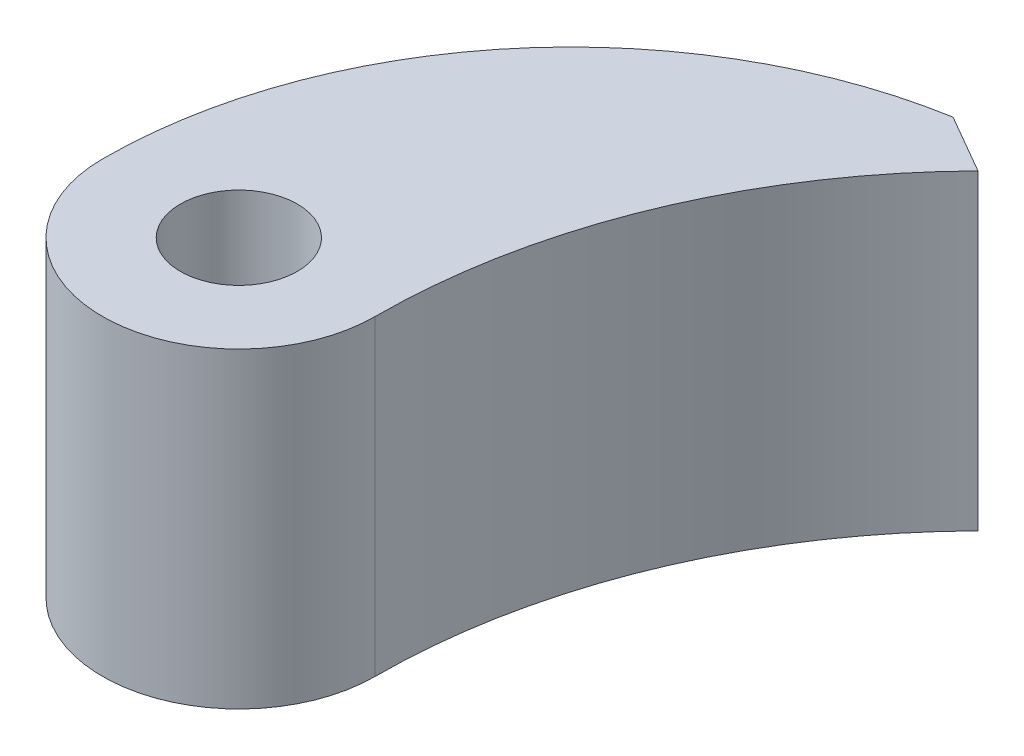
ISO-10303-21;
HEADER;
FILE_DESCRIPTION(('STEP AP214'),'2;1');
FILE_NAME('part.step','',(''),(''),'','','');
FILE_SCHEMA(('AUTOMOTIVE_DESIGN { 1 0 10303 214 1 1 1 1 }'));
ENDSEC;
DATA;
#1=APPLICATION_CONTEXT('core data for automotive mechanical design processes');
#2=APPLICATION_PROTOCOL_DEFINITION('international standard','automotive_design',2000,#1);
#3=PRODUCT_CONTEXT('',#1,'mechanical');
#4=PRODUCT('Part','Part','',(#3));
#5=PRODUCT_RELATED_PRODUCT_CATEGORY('part','',(#4));
#6=PRODUCT_DEFINITION_FORMATION('','',#4);
#7=PRODUCT_DEFINITION_CONTEXT('part definition',#1,'design');
#8=PRODUCT_DEFINITION('design','',#6,#7);
#9=PRODUCT_DEFINITION_SHAPE('','',#8);
#10=(LENGTH_UNIT() NAMED_UNIT(*) SI_UNIT(.MILLI.,.METRE.));
#11=(NAMED_UNIT(*) PLANE_ANGLE_UNIT() SI_UNIT($,.RADIAN.));
#12=(NAMED_UNIT(*) SI_UNIT($,.STERADIAN.) SOLID_ANGLE_UNIT());
#13=UNCERTAINTY_MEASURE_WITH_UNIT(LENGTH_MEASURE(1.E-05),#10,'distance_accuracy_value','');
#14=(GEOMETRIC_REPRESENTATION_CONTEXT(3) GLOBAL_UNCERTAINTY_ASSIGNED_CONTEXT((#13)) GLOBAL_UNIT_ASSIGNED_CONTEXT((#10,
#11,#12)) REPRESENTATION_CONTEXT('',''));
#15=CARTESIAN_POINT('',(0.,0.,0.));
#16=DIRECTION('',(0.,0.,1.));
#17=DIRECTION('',(1.,0.,0.));
#18=AXIS2_PLACEMENT_3D('',#15,#16,#17);
#19=CARTESIAN_POINT('',(-31.2165063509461,-26.5,7.18182368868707));
#20=DIRECTION('',(0.,-1.,0.));
#21=DIRECTION('',(0.,0.,-1.));
#22=AXIS2_PLACEMENT_3D('',#19,#20,#21);
#23=PLANE('',#22);
#24=CARTESIAN_POINT('',(-31.2165063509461,-26.5,7.18182368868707));
#25=DIRECTION('',(0.,1.,0.));
#26=DIRECTION('',(0.,0.,-1.));
#27=AXIS2_PLACEMENT_3D('',#24,#25,#26);
#28=CIRCLE('',#27,3.5);
#29=CARTESIAN_POINT('',(-34.7165063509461,-26.5,7.18182368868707));
#30=VERTEX_POINT('',#29);
#31=CARTESIAN_POINT('',(-27.7165063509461,-26.5,7.18182368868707));
#32=VERTEX_POINT('',#31);
#33=EDGE_CURVE('E84',#30,#32,#28,.T.);
#34=ORIENTED_EDGE('',*,*,#33,.T.);
#35=CARTESIAN_POINT('',(-12.0961359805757,-26.5,7.18182368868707));
#36=DIRECTION('',(0.,-1.,0.));
#37=DIRECTION('',(0.,0.,1.));
#38=AXIS2_PLACEMENT_3D('',#35,#36,#37);
#39=CIRCLE('',#38,15.6203703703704);
#40=CARTESIAN_POINT('',(-23.2165063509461,-26.5,-3.78783142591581));
#41=VERTEX_POINT('',#40);
#42=EDGE_CURVE('E79',#32,#41,#39,.T.);
#43=ORIENTED_EDGE('',*,*,#42,.T.);
#44=DIRECTION('',(-0.866025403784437,0.,-0.500000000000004));
#45=VECTOR('',#44,1.);
#46=CARTESIAN_POINT('',(-24.7320508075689,-26.5,-4.66283142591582));
#47=LINE('',#46,#45);
#48=CARTESIAN_POINT('',(-24.7320508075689,-26.5,-4.66283142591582));
#49=VERTEX_POINT('',#48);
#50=EDGE_CURVE('E82',#41,#49,#47,.T.);
#51=ORIENTED_EDGE('',*,*,#50,.T.);
#52=CARTESIAN_POINT('',(-22.6985647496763,-26.5,7.18182368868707));
#53=DIRECTION('',(0.,1.,0.));
#54=DIRECTION('',(0.,0.,-1.));
#55=AXIS2_PLACEMENT_3D('',#52,#53,#54);
#56=CIRCLE('',#55,12.0179416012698);
#57=EDGE_CURVE('E49',#49,#30,#56,.T.);
#58=ORIENTED_EDGE('',*,*,#57,.T.);
#59=EDGE_LOOP('',(#34,#43,#51,#58));
#60=FACE_BOUND('',#59,.T.);
#61=CARTESIAN_POINT('',(-31.2165063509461,-26.5,7.18182368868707));
#62=DIRECTION('',(0.,1.,0.));
#63=DIRECTION('',(0.,0.,-1.));
#64=AXIS2_PLACEMENT_3D('',#61,#62,#63);
#65=CIRCLE('',#64,1.50000000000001);
#66=CARTESIAN_POINT('',(-31.2165063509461,-26.5,5.68182368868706));
#67=VERTEX_POINT('',#66);
#68=EDGE_CURVE('E99',#67,#67,#65,.T.);
#69=ORIENTED_EDGE('',*,*,#68,.F.);
#70=EDGE_LOOP('',(#69));
#71=FACE_BOUND('',#70,.T.);
#72=ADVANCED_FACE('F32',(#60,#71),#23,.F.);
#73=CARTESIAN_POINT('',(-31.2165063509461,-34.5,7.18182368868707));
#74=DIRECTION('',(0.,-1.,0.));
#75=DIRECTION('',(0.,0.,-1.));
#76=AXIS2_PLACEMENT_3D('',#73,#74,#75);
#77=PLANE('',#76);
#78=CARTESIAN_POINT('',(-31.2165063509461,-34.5,7.18182368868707));
#79=DIRECTION('',(0.,1.,0.));
#80=DIRECTION('',(0.,0.,-1.));
#81=AXIS2_PLACEMENT_3D('',#78,#79,#80);
#82=CIRCLE('',#81,3.5);
#83=CARTESIAN_POINT('',(-34.7165063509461,-34.5,7.18182368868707));
#84=VERTEX_POINT('',#83);
#85=CARTESIAN_POINT('',(-27.7165063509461,-34.5,7.18182368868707));
#86=VERTEX_POINT('',#85);
#87=EDGE_CURVE('E96',#84,#86,#82,.T.);
#88=ORIENTED_EDGE('',*,*,#87,.F.);
#89=CARTESIAN_POINT('',(-22.6985647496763,-34.5,7.18182368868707));
#90=DIRECTION('',(0.,1.,0.));
#91=DIRECTION('',(0.,0.,-1.));
#92=AXIS2_PLACEMENT_3D('',#89,#90,#91);
#93=CIRCLE('',#92,12.0179416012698);
#94=CARTESIAN_POINT('',(-24.7320508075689,-34.5,-4.66283142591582));
#95=VERTEX_POINT('',#94);
#96=EDGE_CURVE('E72',#95,#84,#93,.T.);
#97=ORIENTED_EDGE('',*,*,#96,.F.);
#98=DIRECTION('',(-0.866025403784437,0.,-0.500000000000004));
#99=VECTOR('',#98,1.);
#100=CARTESIAN_POINT('',(-24.7320508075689,-34.5,-4.66283142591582));
#101=LINE('',#100,#99);
#102=CARTESIAN_POINT('',(-23.2165063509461,-34.5,-3.78783142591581));
#103=VERTEX_POINT('',#102);
#104=EDGE_CURVE('E66',#103,#95,#101,.T.);
#105=ORIENTED_EDGE('',*,*,#104,.F.);
#106=CARTESIAN_POINT('',(-12.0961359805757,-34.5,7.18182368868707));
#107=DIRECTION('',(0.,-1.,0.));
#108=DIRECTION('',(0.,0.,1.));
#109=AXIS2_PLACEMENT_3D('',#106,#107,#108);
#110=CIRCLE('',#109,15.6203703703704);
#111=EDGE_CURVE('E88',#86,#103,#110,.T.);
#112=ORIENTED_EDGE('',*,*,#111,.F.);
#113=EDGE_LOOP('',(#88,#97,#105,#112));
#114=FACE_BOUND('',#113,.T.);
#115=CARTESIAN_POINT('',(-31.2165063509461,-34.5,7.18182368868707));
#116=DIRECTION('',(0.,1.,0.));
#117=DIRECTION('',(0.,0.,-1.));
#118=AXIS2_PLACEMENT_3D('',#115,#116,#117);
#119=CIRCLE('',#118,1.50000000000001);
#120=CARTESIAN_POINT('',(-31.2165063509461,-34.5,5.68182368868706));
#121=VERTEX_POINT('',#120);
#122=EDGE_CURVE('E111',#121,#121,#119,.T.);
#123=ORIENTED_EDGE('',*,*,#122,.T.);
#124=EDGE_LOOP('',(#123));
#125=FACE_BOUND('',#124,.T.);
#126=ADVANCED_FACE('F107',(#114,#125),#77,.T.);
#127=CARTESIAN_POINT('',(-31.2165063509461,-26.5,7.18182368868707));
#128=DIRECTION('',(0.,-1.,0.));
#129=DIRECTION('',(0.,0.,-1.));
#130=AXIS2_PLACEMENT_3D('',#127,#128,#129);
#131=CYLINDRICAL_SURFACE('',#130,3.5);
#132=ORIENTED_EDGE('',*,*,#87,.T.);
#133=DIRECTION('',(0.,-1.,0.));
#134=VECTOR('',#133,1.);
#135=CARTESIAN_POINT('',(-27.7165063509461,-26.5,7.18182368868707));
#136=LINE('',#135,#134);
#137=EDGE_CURVE('E11',#32,#86,#136,.T.);
#138=ORIENTED_EDGE('',*,*,#137,.F.);
#139=ORIENTED_EDGE('',*,*,#33,.F.);
#140=DIRECTION('',(0.,-1.,0.));
#141=VECTOR('',#140,1.);
#142=CARTESIAN_POINT('',(-34.7165063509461,-26.5,7.18182368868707));
#143=LINE('',#142,#141);
#144=EDGE_CURVE('E92',#30,#84,#143,.T.);
#145=ORIENTED_EDGE('',*,*,#144,.T.);
#146=EDGE_LOOP('',(#132,#138,#139,#145));
#147=FACE_BOUND('',#146,.T.);
#148=ADVANCED_FACE('F34',(#147),#131,.T.);
#149=CARTESIAN_POINT('',(-12.0961359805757,-26.5,7.18182368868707));
#150=DIRECTION('',(0.,-1.,0.));
#151=DIRECTION('',(0.,0.,-1.));
#152=AXIS2_PLACEMENT_3D('',#149,#150,#151);
#153=CYLINDRICAL_SURFACE('',#152,15.6203703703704);
#154=ORIENTED_EDGE('',*,*,#111,.T.);
#155=DIRECTION('',(0.,-1.,0.));
#156=VECTOR('',#155,1.);
#157=CARTESIAN_POINT('',(-23.2165063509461,-26.5,-3.78783142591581));
#158=LINE('',#157,#156);
#159=EDGE_CURVE('E41',#41,#103,#158,.T.);
#160=ORIENTED_EDGE('',*,*,#159,.F.);
#161=ORIENTED_EDGE('',*,*,#42,.F.);
#162=ORIENTED_EDGE('',*,*,#137,.T.);
#163=EDGE_LOOP('',(#154,#160,#161,#162));
#164=FACE_BOUND('',#163,.T.);
#165=ADVANCED_FACE('F87',(#164),#153,.F.);
#166=CARTESIAN_POINT('',(-24.7320508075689,-26.5,-4.66283142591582));
#167=DIRECTION('',(-0.500000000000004,0.,0.866025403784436));
#168=DIRECTION('',(0.866025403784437,0.,0.500000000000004));
#169=AXIS2_PLACEMENT_3D('',#166,#167,#168);
#170=PLANE('',#169);
#171=ORIENTED_EDGE('',*,*,#104,.T.);
#172=DIRECTION('',(0.,-1.,0.));
#173=VECTOR('',#172,1.);
#174=CARTESIAN_POINT('',(-24.7320508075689,-26.5,-4.66283142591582));
#175=LINE('',#174,#173);
#176=EDGE_CURVE('E89',#49,#95,#175,.T.);
#177=ORIENTED_EDGE('',*,*,#176,.F.);
#178=ORIENTED_EDGE('',*,*,#50,.F.);
#179=ORIENTED_EDGE('',*,*,#159,.T.);
#180=EDGE_LOOP('',(#171,#177,#178,#179));
#181=FACE_BOUND('',#180,.T.);
#182=ADVANCED_FACE('F90',(#181),#170,.F.);
#183=CARTESIAN_POINT('',(-22.6985647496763,-26.5,7.18182368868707));
#184=DIRECTION('',(0.,-1.,0.));
#185=DIRECTION('',(0.,0.,-1.));
#186=AXIS2_PLACEMENT_3D('',#183,#184,#185);
#187=CYLINDRICAL_SURFACE('',#186,12.0179416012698);
#188=ORIENTED_EDGE('',*,*,#96,.T.);
#189=ORIENTED_EDGE('',*,*,#144,.F.);
#190=ORIENTED_EDGE('',*,*,#57,.F.);
#191=ORIENTED_EDGE('',*,*,#176,.T.);
#192=EDGE_LOOP('',(#188,#189,#190,#191));
#193=FACE_BOUND('',#192,.T.);
#194=ADVANCED_FACE('F104',(#193),#187,.T.);
#195=CARTESIAN_POINT('',(-31.2165063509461,-26.5,7.18182368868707));
#196=DIRECTION('',(0.,-1.,0.));
#197=DIRECTION('',(0.,0.,-1.));
#198=AXIS2_PLACEMENT_3D('',#195,#196,#197);
#199=CYLINDRICAL_SURFACE('',#198,1.50000000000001);
#200=ORIENTED_EDGE('',*,*,#68,.T.);
#201=EDGE_LOOP('',(#200));
#202=FACE_BOUND('',#201,.T.);
#203=ORIENTED_EDGE('',*,*,#122,.F.);
#204=EDGE_LOOP('',(#203));
#205=FACE_BOUND('',#204,.T.);
#206=ADVANCED_FACE('F117',(#202,#205),#199,.F.);
#207=CLOSED_SHELL('',(#72,#126,#148,#165,#182,#194,#206));
#208=MANIFOLD_SOLID_BREP('B2',#207);
#209=ADVANCED_BREP_SHAPE_REPRESENTATION('',(#18,#208),#14);
#210=SHAPE_DEFINITION_REPRESENTATION(#9,#209);
ENDSEC;
END-ISO-10303-21;
